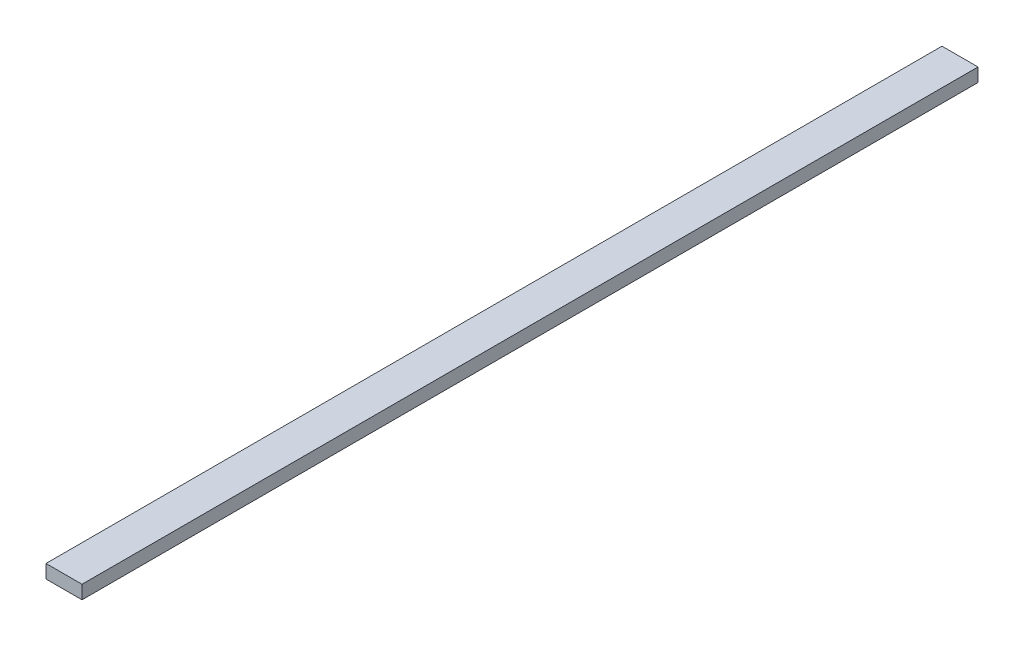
ISO-10303-21;
HEADER;
FILE_DESCRIPTION(('STEP AP214'),'2;1');
FILE_NAME('part.step','',(''),(''),'','','');
FILE_SCHEMA(('AUTOMOTIVE_DESIGN { 1 0 10303 214 1 1 1 1 }'));
ENDSEC;
DATA;
#1=APPLICATION_CONTEXT('core data for automotive mechanical design processes');
#2=APPLICATION_PROTOCOL_DEFINITION('international standard','automotive_design',2000,#1);
#3=PRODUCT_CONTEXT('',#1,'mechanical');
#4=PRODUCT('Part','Part','',(#3));
#5=PRODUCT_RELATED_PRODUCT_CATEGORY('part','',(#4));
#6=PRODUCT_DEFINITION_FORMATION('','',#4);
#7=PRODUCT_DEFINITION_CONTEXT('part definition',#1,'design');
#8=PRODUCT_DEFINITION('design','',#6,#7);
#9=PRODUCT_DEFINITION_SHAPE('','',#8);
#10=(LENGTH_UNIT() NAMED_UNIT(*) SI_UNIT(.MILLI.,.METRE.));
#11=(NAMED_UNIT(*) PLANE_ANGLE_UNIT() SI_UNIT($,.RADIAN.));
#12=(NAMED_UNIT(*) SI_UNIT($,.STERADIAN.) SOLID_ANGLE_UNIT());
#13=UNCERTAINTY_MEASURE_WITH_UNIT(LENGTH_MEASURE(1.E-05),#10,'distance_accuracy_value','');
#14=(GEOMETRIC_REPRESENTATION_CONTEXT(3) GLOBAL_UNCERTAINTY_ASSIGNED_CONTEXT((#13)) GLOBAL_UNIT_ASSIGNED_CONTEXT((#10,
#11,#12)) REPRESENTATION_CONTEXT('',''));
#15=CARTESIAN_POINT('',(0.,0.,0.));
#16=DIRECTION('',(0.,0.,1.));
#17=DIRECTION('',(1.,0.,0.));
#18=AXIS2_PLACEMENT_3D('',#15,#16,#17);
#19=CARTESIAN_POINT('',(-20.,7.5,995.));
#20=DIRECTION('',(1.,0.,0.));
#21=DIRECTION('',(0.,1.,0.));
#22=AXIS2_PLACEMENT_3D('',#19,#20,#21);
#23=PLANE('',#22);
#24=DIRECTION('',(0.,-1.,0.));
#25=VECTOR('',#24,1.);
#26=CARTESIAN_POINT('',(-20.,7.5,0.));
#27=LINE('',#26,#25);
#28=CARTESIAN_POINT('',(-20.,7.5,0.));
#29=VERTEX_POINT('',#28);
#30=CARTESIAN_POINT('',(-20.,-7.5,0.));
#31=VERTEX_POINT('',#30);
#32=EDGE_CURVE('E105',#29,#31,#27,.T.);
#33=ORIENTED_EDGE('',*,*,#32,.T.);
#34=DIRECTION('',(0.,0.,-1.));
#35=VECTOR('',#34,1.);
#36=CARTESIAN_POINT('',(-20.,-7.5,995.));
#37=LINE('',#36,#35);
#38=CARTESIAN_POINT('',(-20.,-7.5,995.));
#39=VERTEX_POINT('',#38);
#40=EDGE_CURVE('E11',#39,#31,#37,.T.);
#41=ORIENTED_EDGE('',*,*,#40,.F.);
#42=DIRECTION('',(0.,-1.,0.));
#43=VECTOR('',#42,1.);
#44=CARTESIAN_POINT('',(-20.,7.5,995.));
#45=LINE('',#44,#43);
#46=CARTESIAN_POINT('',(-20.,7.5,995.));
#47=VERTEX_POINT('',#46);
#48=EDGE_CURVE('E88',#47,#39,#45,.T.);
#49=ORIENTED_EDGE('',*,*,#48,.F.);
#50=DIRECTION('',(0.,0.,-1.));
#51=VECTOR('',#50,1.);
#52=CARTESIAN_POINT('',(-20.,7.5,995.));
#53=LINE('',#52,#51);
#54=EDGE_CURVE('E101',#47,#29,#53,.T.);
#55=ORIENTED_EDGE('',*,*,#54,.T.);
#56=EDGE_LOOP('',(#33,#41,#49,#55));
#57=FACE_BOUND('',#56,.T.);
#58=ADVANCED_FACE('F36',(#57),#23,.F.);
#59=CARTESIAN_POINT('',(-20.,-7.5,995.));
#60=DIRECTION('',(0.,1.,0.));
#61=DIRECTION('',(-1.,0.,0.));
#62=AXIS2_PLACEMENT_3D('',#59,#60,#61);
#63=PLANE('',#62);
#64=DIRECTION('',(1.,0.,0.));
#65=VECTOR('',#64,1.);
#66=CARTESIAN_POINT('',(-20.,-7.5,0.));
#67=LINE('',#66,#65);
#68=CARTESIAN_POINT('',(20.,-7.5,0.));
#69=VERTEX_POINT('',#68);
#70=EDGE_CURVE('E93',#31,#69,#67,.T.);
#71=ORIENTED_EDGE('',*,*,#70,.T.);
#72=DIRECTION('',(0.,0.,-1.));
#73=VECTOR('',#72,1.);
#74=CARTESIAN_POINT('',(20.,-7.5,995.));
#75=LINE('',#74,#73);
#76=CARTESIAN_POINT('',(20.,-7.5,995.));
#77=VERTEX_POINT('',#76);
#78=EDGE_CURVE('E45',#77,#69,#75,.T.);
#79=ORIENTED_EDGE('',*,*,#78,.F.);
#80=DIRECTION('',(1.,0.,0.));
#81=VECTOR('',#80,1.);
#82=CARTESIAN_POINT('',(-20.,-7.5,995.));
#83=LINE('',#82,#81);
#84=EDGE_CURVE('E83',#39,#77,#83,.T.);
#85=ORIENTED_EDGE('',*,*,#84,.F.);
#86=ORIENTED_EDGE('',*,*,#40,.T.);
#87=EDGE_LOOP('',(#71,#79,#85,#86));
#88=FACE_BOUND('',#87,.T.);
#89=ADVANCED_FACE('F92',(#88),#63,.F.);
#90=CARTESIAN_POINT('',(20.,7.5,995.));
#91=DIRECTION('',(-1.,0.,0.));
#92=DIRECTION('',(0.,-1.,0.));
#93=AXIS2_PLACEMENT_3D('',#90,#91,#92);
#94=PLANE('',#93);
#95=DIRECTION('',(0.,1.,0.));
#96=VECTOR('',#95,1.);
#97=CARTESIAN_POINT('',(20.,7.5,0.));
#98=LINE('',#97,#96);
#99=CARTESIAN_POINT('',(20.,7.5,0.));
#100=VERTEX_POINT('',#99);
#101=EDGE_CURVE('E70',#69,#100,#98,.T.);
#102=ORIENTED_EDGE('',*,*,#101,.T.);
#103=DIRECTION('',(0.,0.,-1.));
#104=VECTOR('',#103,1.);
#105=CARTESIAN_POINT('',(20.,7.5,995.));
#106=LINE('',#105,#104);
#107=CARTESIAN_POINT('',(20.,7.5,995.));
#108=VERTEX_POINT('',#107);
#109=EDGE_CURVE('E95',#108,#100,#106,.T.);
#110=ORIENTED_EDGE('',*,*,#109,.F.);
#111=DIRECTION('',(0.,1.,0.));
#112=VECTOR('',#111,1.);
#113=CARTESIAN_POINT('',(20.,7.5,995.));
#114=LINE('',#113,#112);
#115=EDGE_CURVE('E86',#77,#108,#114,.T.);
#116=ORIENTED_EDGE('',*,*,#115,.F.);
#117=ORIENTED_EDGE('',*,*,#78,.T.);
#118=EDGE_LOOP('',(#102,#110,#116,#117));
#119=FACE_BOUND('',#118,.T.);
#120=ADVANCED_FACE('F96',(#119),#94,.F.);
#121=CARTESIAN_POINT('',(-20.,7.5,995.));
#122=DIRECTION('',(0.,-1.,0.));
#123=DIRECTION('',(1.,0.,0.));
#124=AXIS2_PLACEMENT_3D('',#121,#122,#123);
#125=PLANE('',#124);
#126=DIRECTION('',(-1.,0.,0.));
#127=VECTOR('',#126,1.);
#128=CARTESIAN_POINT('',(-20.,7.5,0.));
#129=LINE('',#128,#127);
#130=EDGE_CURVE('E76',#100,#29,#129,.T.);
#131=ORIENTED_EDGE('',*,*,#130,.T.);
#132=ORIENTED_EDGE('',*,*,#54,.F.);
#133=DIRECTION('',(-1.,0.,0.));
#134=VECTOR('',#133,1.);
#135=CARTESIAN_POINT('',(-20.,7.5,995.));
#136=LINE('',#135,#134);
#137=EDGE_CURVE('E53',#108,#47,#136,.T.);
#138=ORIENTED_EDGE('',*,*,#137,.F.);
#139=ORIENTED_EDGE('',*,*,#109,.T.);
#140=EDGE_LOOP('',(#131,#132,#138,#139));
#141=FACE_BOUND('',#140,.T.);
#142=ADVANCED_FACE('F117',(#141),#125,.F.);
#143=CARTESIAN_POINT('',(-20.,-7.5,995.));
#144=DIRECTION('',(0.,0.,1.));
#145=DIRECTION('',(1.,0.,0.));
#146=AXIS2_PLACEMENT_3D('',#143,#144,#145);
#147=PLANE('',#146);
#148=ORIENTED_EDGE('',*,*,#48,.T.);
#149=ORIENTED_EDGE('',*,*,#84,.T.);
#150=ORIENTED_EDGE('',*,*,#115,.T.);
#151=ORIENTED_EDGE('',*,*,#137,.T.);
#152=EDGE_LOOP('',(#148,#149,#150,#151));
#153=FACE_BOUND('',#152,.T.);
#154=ADVANCED_FACE('F84',(#153),#147,.T.);
#155=CARTESIAN_POINT('',(-20.,-7.5,0.));
#156=DIRECTION('',(0.,0.,1.));
#157=DIRECTION('',(1.,0.,0.));
#158=AXIS2_PLACEMENT_3D('',#155,#156,#157);
#159=PLANE('',#158);
#160=ORIENTED_EDGE('',*,*,#32,.F.);
#161=ORIENTED_EDGE('',*,*,#130,.F.);
#162=ORIENTED_EDGE('',*,*,#101,.F.);
#163=ORIENTED_EDGE('',*,*,#70,.F.);
#164=EDGE_LOOP('',(#160,#161,#162,#163));
#165=FACE_BOUND('',#164,.T.);
#166=ADVANCED_FACE('F120',(#165),#159,.F.);
#167=CLOSED_SHELL('',(#58,#89,#120,#142,#154,#166));
#168=MANIFOLD_SOLID_BREP('B2',#167);
#169=ADVANCED_BREP_SHAPE_REPRESENTATION('',(#18,#168),#14);
#170=SHAPE_DEFINITION_REPRESENTATION(#9,#169);
ENDSEC;
END-ISO-10303-21;
